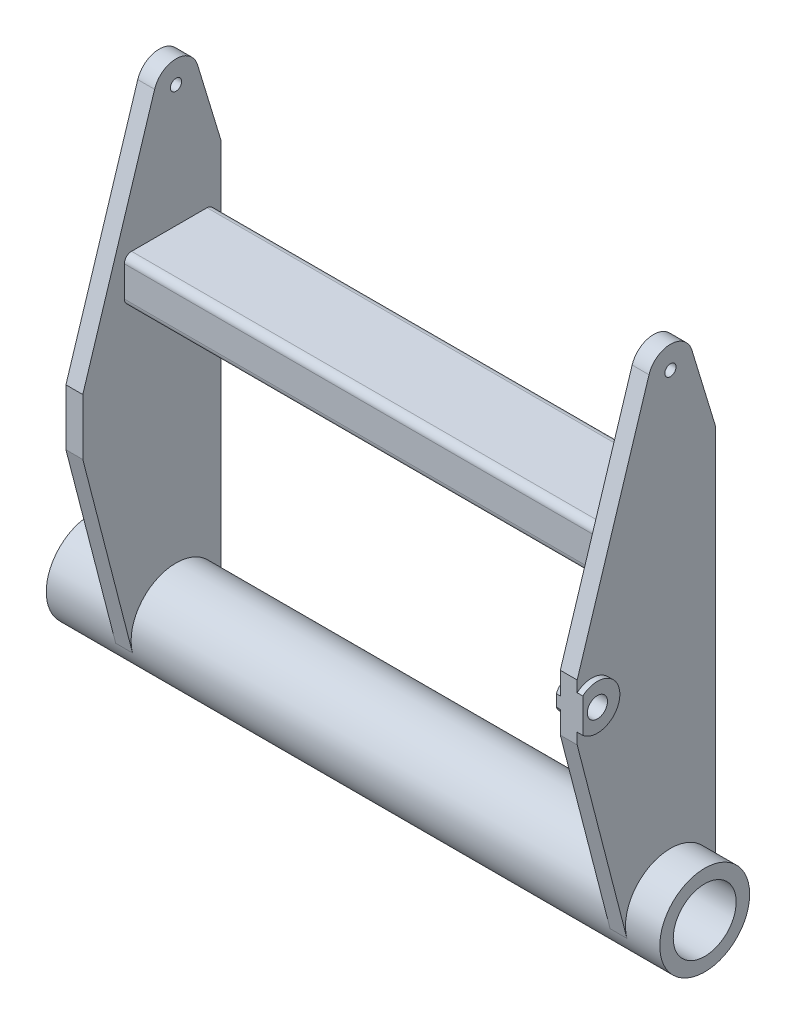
ISO-10303-21;
HEADER;
FILE_DESCRIPTION(('STEP AP214'),'2;1');
FILE_NAME('part.step','',(''),(''),'','','');
FILE_SCHEMA(('AUTOMOTIVE_DESIGN { 1 0 10303 214 1 1 1 1 }'));
ENDSEC;
DATA;
#1=APPLICATION_CONTEXT('core data for automotive mechanical design processes');
#2=APPLICATION_PROTOCOL_DEFINITION('international standard','automotive_design',2000,#1);
#3=PRODUCT_CONTEXT('',#1,'mechanical');
#4=PRODUCT('Part','Part','',(#3));
#5=PRODUCT_RELATED_PRODUCT_CATEGORY('part','',(#4));
#6=PRODUCT_DEFINITION_FORMATION('','',#4);
#7=PRODUCT_DEFINITION_CONTEXT('part definition',#1,'design');
#8=PRODUCT_DEFINITION('design','',#6,#7);
#9=PRODUCT_DEFINITION_SHAPE('','',#8);
#10=(LENGTH_UNIT() NAMED_UNIT(*) SI_UNIT(.MILLI.,.METRE.));
#11=(NAMED_UNIT(*) PLANE_ANGLE_UNIT() SI_UNIT($,.RADIAN.));
#12=(NAMED_UNIT(*) SI_UNIT($,.STERADIAN.) SOLID_ANGLE_UNIT());
#13=UNCERTAINTY_MEASURE_WITH_UNIT(LENGTH_MEASURE(1.E-05),#10,'distance_accuracy_value','');
#14=(GEOMETRIC_REPRESENTATION_CONTEXT(3) GLOBAL_UNCERTAINTY_ASSIGNED_CONTEXT((#13)) GLOBAL_UNIT_ASSIGNED_CONTEXT((#10,
#11,#12)) REPRESENTATION_CONTEXT('',''));
#15=CARTESIAN_POINT('',(0.,0.,0.));
#16=DIRECTION('',(0.,0.,1.));
#17=DIRECTION('',(1.,0.,0.));
#18=AXIS2_PLACEMENT_3D('',#15,#16,#17);
#19=CARTESIAN_POINT('',(212.5,0.,0.));
#20=DIRECTION('',(1.,0.,0.));
#21=DIRECTION('',(0.,0.,-1.));
#22=AXIS2_PLACEMENT_3D('',#19,#20,#21);
#23=PLANE('',#22);
#24=CARTESIAN_POINT('',(212.5,408.6,0.));
#25=DIRECTION('',(1.,0.,0.));
#26=DIRECTION('',(0.,0.,-1.));
#27=AXIS2_PLACEMENT_3D('',#24,#25,#26);
#28=CIRCLE('',#27,5.);
#29=CARTESIAN_POINT('',(212.5,408.6,-5.));
#30=VERTEX_POINT('',#29);
#31=EDGE_CURVE('E548',#30,#30,#28,.T.);
#32=ORIENTED_EDGE('',*,*,#31,.T.);
#33=EDGE_LOOP('',(#32));
#34=FACE_BOUND('',#33,.T.);
#35=CARTESIAN_POINT('',(212.5,293.6,-27.6));
#36=DIRECTION('',(-1.,0.,0.));
#37=DIRECTION('',(0.,0.,-1.));
#38=AXIS2_PLACEMENT_3D('',#35,#36,#37);
#39=CIRCLE('',#38,6.39999999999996);
#40=CARTESIAN_POINT('',(212.5,300.,-27.6));
#41=VERTEX_POINT('',#40);
#42=CARTESIAN_POINT('',(212.5,293.6,-34.));
#43=VERTEX_POINT('',#42);
#44=EDGE_CURVE('E396',#41,#43,#39,.T.);
#45=ORIENTED_EDGE('',*,*,#44,.F.);
#46=DIRECTION('',(0.,0.,-1.));
#47=VECTOR('',#46,1.);
#48=CARTESIAN_POINT('',(212.5,300.,-27.6));
#49=LINE('',#48,#47);
#50=CARTESIAN_POINT('',(212.5,300.,39.6));
#51=VERTEX_POINT('',#50);
#52=EDGE_CURVE('E375',#51,#41,#49,.T.);
#53=ORIENTED_EDGE('',*,*,#52,.F.);
#54=CARTESIAN_POINT('',(212.5,293.6,39.6));
#55=DIRECTION('',(-1.,0.,0.));
#56=DIRECTION('',(0.,0.,-1.));
#57=AXIS2_PLACEMENT_3D('',#54,#55,#56);
#58=CIRCLE('',#57,6.40000000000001);
#59=CARTESIAN_POINT('',(212.5,293.6,46.));
#60=VERTEX_POINT('',#59);
#61=EDGE_CURVE('E378',#60,#51,#58,.T.);
#62=ORIENTED_EDGE('',*,*,#61,.F.);
#63=DIRECTION('',(0.,1.,0.));
#64=VECTOR('',#63,1.);
#65=CARTESIAN_POINT('',(212.5,293.6,46.));
#66=LINE('',#65,#64);
#67=CARTESIAN_POINT('',(212.5,266.4,46.));
#68=VERTEX_POINT('',#67);
#69=EDGE_CURVE('E381',#68,#60,#66,.T.);
#70=ORIENTED_EDGE('',*,*,#69,.F.);
#71=CARTESIAN_POINT('',(212.5,266.4,39.6));
#72=DIRECTION('',(-1.,0.,0.));
#73=DIRECTION('',(0.,0.,-1.));
#74=AXIS2_PLACEMENT_3D('',#71,#72,#73);
#75=CIRCLE('',#74,6.39999999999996);
#76=CARTESIAN_POINT('',(212.5,260.,39.6));
#77=VERTEX_POINT('',#76);
#78=EDGE_CURVE('E384',#77,#68,#75,.T.);
#79=ORIENTED_EDGE('',*,*,#78,.F.);
#80=DIRECTION('',(0.,0.,1.));
#81=VECTOR('',#80,1.);
#82=CARTESIAN_POINT('',(212.5,260.,-27.6));
#83=LINE('',#82,#81);
#84=CARTESIAN_POINT('',(212.5,260.,-27.6));
#85=VERTEX_POINT('',#84);
#86=EDGE_CURVE('E387',#85,#77,#83,.T.);
#87=ORIENTED_EDGE('',*,*,#86,.F.);
#88=CARTESIAN_POINT('',(212.5,266.4,-27.6));
#89=DIRECTION('',(-1.,0.,0.));
#90=DIRECTION('',(0.,0.,-1.));
#91=AXIS2_PLACEMENT_3D('',#88,#89,#90);
#92=CIRCLE('',#91,6.39999999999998);
#93=CARTESIAN_POINT('',(212.5,266.4,-34.));
#94=VERTEX_POINT('',#93);
#95=EDGE_CURVE('E390',#94,#85,#92,.T.);
#96=ORIENTED_EDGE('',*,*,#95,.F.);
#97=DIRECTION('',(0.,-1.,0.));
#98=VECTOR('',#97,1.);
#99=CARTESIAN_POINT('',(212.5,293.6,-34.));
#100=LINE('',#99,#98);
#101=EDGE_CURVE('E393',#43,#94,#100,.T.);
#102=ORIENTED_EDGE('',*,*,#101,.F.);
#103=EDGE_LOOP('',(#45,#53,#62,#70,#79,#87,#96,#102));
#104=FACE_BOUND('',#103,.T.);
#105=CARTESIAN_POINT('',(212.5,186.3,70.));
#106=DIRECTION('',(-1.,0.,0.));
#107=DIRECTION('',(0.,0.,1.));
#108=AXIS2_PLACEMENT_3D('',#105,#106,#107);
#109=CIRCLE('',#108,14.);
#110=CARTESIAN_POINT('',(212.5,191.496152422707,83.));
#111=VERTEX_POINT('',#110);
#112=CARTESIAN_POINT('',(212.5,181.103847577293,83.));
#113=VERTEX_POINT('',#112);
#114=EDGE_CURVE('E44',#111,#113,#109,.T.);
#115=ORIENTED_EDGE('',*,*,#114,.F.);
#116=DIRECTION('',(0.,-1.,0.));
#117=VECTOR('',#116,1.);
#118=CARTESIAN_POINT('',(212.5,161.3,83.));
#119=LINE('',#118,#117);
#120=CARTESIAN_POINT('',(212.5,211.3,83.));
#121=VERTEX_POINT('',#120);
#122=EDGE_CURVE('E264',#121,#111,#119,.T.);
#123=ORIENTED_EDGE('',*,*,#122,.F.);
#124=DIRECTION('',(0.,-0.953957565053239,0.299941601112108));
#125=VECTOR('',#124,1.);
#126=CARTESIAN_POINT('',(212.5,211.3,83.));
#127=LINE('',#126,#125);
#128=CARTESIAN_POINT('',(212.5,414.598832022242,19.0791513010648));
#129=VERTEX_POINT('',#128);
#130=EDGE_CURVE('E278',#129,#121,#127,.T.);
#131=ORIENTED_EDGE('',*,*,#130,.F.);
#132=CARTESIAN_POINT('',(212.5,408.6,0.));
#133=DIRECTION('',(1.,0.,0.));
#134=DIRECTION('',(0.,0.,-1.));
#135=AXIS2_PLACEMENT_3D('',#132,#133,#134);
#136=CIRCLE('',#135,20.);
#137=CARTESIAN_POINT('',(212.5,414.414043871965,-19.1362716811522));
#138=VERTEX_POINT('',#137);
#139=EDGE_CURVE('E320',#138,#129,#136,.T.);
#140=ORIENTED_EDGE('',*,*,#139,.F.);
#141=DIRECTION('',(0.,0.956813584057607,0.290702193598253));
#142=VECTOR('',#141,1.);
#143=CARTESIAN_POINT('',(212.5,345.743428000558,-40.));
#144=LINE('',#143,#142);
#145=CARTESIAN_POINT('',(212.5,345.743428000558,-40.));
#146=VERTEX_POINT('',#145);
#147=EDGE_CURVE('E316',#146,#138,#144,.T.);
#148=ORIENTED_EDGE('',*,*,#147,.F.);
#149=DIRECTION('',(0.,1.,0.));
#150=VECTOR('',#149,1.);
#151=CARTESIAN_POINT('',(212.5,0.,-40.));
#152=LINE('',#151,#150);
#153=CARTESIAN_POINT('',(212.5,0.,-40.));
#154=VERTEX_POINT('',#153);
#155=EDGE_CURVE('E319',#154,#146,#152,.T.);
#156=ORIENTED_EDGE('',*,*,#155,.F.);
#157=CARTESIAN_POINT('',(212.5,0.,0.));
#158=DIRECTION('',(-1.,0.,0.));
#159=DIRECTION('',(0.,0.,-1.));
#160=AXIS2_PLACEMENT_3D('',#157,#158,#159);
#161=CIRCLE('',#160,40.);
#162=CARTESIAN_POINT('',(212.5,-10.0086252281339,38.727605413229));
#163=VERTEX_POINT('',#162);
#164=EDGE_CURVE('E322',#163,#154,#161,.T.);
#165=ORIENTED_EDGE('',*,*,#164,.F.);
#166=DIRECTION('',(0.,-0.968190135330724,-0.250215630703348));
#167=VECTOR('',#166,1.);
#168=CARTESIAN_POINT('',(212.5,-10.0086252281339,38.727605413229));
#169=LINE('',#168,#167);
#170=CARTESIAN_POINT('',(212.5,161.3,83.));
#171=VERTEX_POINT('',#170);
#172=EDGE_CURVE('E273',#171,#163,#169,.T.);
#173=ORIENTED_EDGE('',*,*,#172,.F.);
#174=EDGE_CURVE('E266',#113,#171,#119,.T.);
#175=ORIENTED_EDGE('',*,*,#174,.F.);
#176=EDGE_LOOP('',(#115,#123,#131,#140,#148,#156,#165,#173,#175));
#177=FACE_BOUND('',#176,.T.);
#178=ADVANCED_FACE('F27',(#34,#104,#177),#23,.F.);
#179=CARTESIAN_POINT('',(227.5,0.,0.));
#180=DIRECTION('',(1.,0.,0.));
#181=DIRECTION('',(0.,0.,-1.));
#182=AXIS2_PLACEMENT_3D('',#179,#180,#181);
#183=PLANE('',#182);
#184=CARTESIAN_POINT('',(227.5,408.6,0.));
#185=DIRECTION('',(1.,0.,0.));
#186=DIRECTION('',(0.,0.,-1.));
#187=AXIS2_PLACEMENT_3D('',#184,#185,#186);
#188=CIRCLE('',#187,5.);
#189=CARTESIAN_POINT('',(227.5,408.6,-5.));
#190=VERTEX_POINT('',#189);
#191=EDGE_CURVE('E554',#190,#190,#188,.T.);
#192=ORIENTED_EDGE('',*,*,#191,.F.);
#193=EDGE_LOOP('',(#192));
#194=FACE_BOUND('',#193,.T.);
#195=DIRECTION('',(0.,-1.,0.));
#196=VECTOR('',#195,1.);
#197=CARTESIAN_POINT('',(227.5,161.3,83.));
#198=LINE('',#197,#196);
#199=CARTESIAN_POINT('',(227.5,211.3,83.));
#200=VERTEX_POINT('',#199);
#201=CARTESIAN_POINT('',(227.5,201.498684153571,83.));
#202=VERTEX_POINT('',#201);
#203=EDGE_CURVE('E52',#200,#202,#198,.T.);
#204=ORIENTED_EDGE('',*,*,#203,.T.);
#205=CARTESIAN_POINT('',(227.5,186.3,70.));
#206=DIRECTION('',(1.,0.,0.));
#207=DIRECTION('',(0.,0.,-1.));
#208=AXIS2_PLACEMENT_3D('',#205,#206,#207);
#209=CIRCLE('',#208,20.);
#210=CARTESIAN_POINT('',(227.5,171.101315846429,83.));
#211=VERTEX_POINT('',#210);
#212=EDGE_CURVE('E537',#211,#202,#209,.T.);
#213=ORIENTED_EDGE('',*,*,#212,.F.);
#214=CARTESIAN_POINT('',(227.5,161.3,83.));
#215=VERTEX_POINT('',#214);
#216=EDGE_CURVE('E292',#211,#215,#198,.T.);
#217=ORIENTED_EDGE('',*,*,#216,.T.);
#218=DIRECTION('',(0.,-0.968190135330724,-0.250215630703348));
#219=VECTOR('',#218,1.);
#220=CARTESIAN_POINT('',(227.5,-10.0086252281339,38.727605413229));
#221=LINE('',#220,#219);
#222=CARTESIAN_POINT('',(227.5,-10.0086252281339,38.727605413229));
#223=VERTEX_POINT('',#222);
#224=EDGE_CURVE('E294',#215,#223,#221,.T.);
#225=ORIENTED_EDGE('',*,*,#224,.T.);
#226=CARTESIAN_POINT('',(227.5,0.,0.));
#227=DIRECTION('',(-1.,0.,0.));
#228=DIRECTION('',(0.,0.,-1.));
#229=AXIS2_PLACEMENT_3D('',#226,#227,#228);
#230=CIRCLE('',#229,40.);
#231=CARTESIAN_POINT('',(227.5,0.,-40.));
#232=VERTEX_POINT('',#231);
#233=EDGE_CURVE('E276',#223,#232,#230,.T.);
#234=ORIENTED_EDGE('',*,*,#233,.T.);
#235=DIRECTION('',(0.,1.,0.));
#236=VECTOR('',#235,1.);
#237=CARTESIAN_POINT('',(227.5,0.,-40.));
#238=LINE('',#237,#236);
#239=CARTESIAN_POINT('',(227.5,345.743428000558,-40.));
#240=VERTEX_POINT('',#239);
#241=EDGE_CURVE('E284',#232,#240,#238,.T.);
#242=ORIENTED_EDGE('',*,*,#241,.T.);
#243=DIRECTION('',(0.,0.956813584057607,0.290702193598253));
#244=VECTOR('',#243,1.);
#245=CARTESIAN_POINT('',(227.5,345.743428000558,-40.));
#246=LINE('',#245,#244);
#247=CARTESIAN_POINT('',(227.5,414.414043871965,-19.1362716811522));
#248=VERTEX_POINT('',#247);
#249=EDGE_CURVE('E286',#240,#248,#246,.T.);
#250=ORIENTED_EDGE('',*,*,#249,.T.);
#251=CARTESIAN_POINT('',(227.5,408.6,0.));
#252=DIRECTION('',(1.,0.,0.));
#253=DIRECTION('',(0.,0.,-1.));
#254=AXIS2_PLACEMENT_3D('',#251,#252,#253);
#255=CIRCLE('',#254,20.);
#256=CARTESIAN_POINT('',(227.5,414.598832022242,19.0791513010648));
#257=VERTEX_POINT('',#256);
#258=EDGE_CURVE('E288',#248,#257,#255,.T.);
#259=ORIENTED_EDGE('',*,*,#258,.T.);
#260=DIRECTION('',(0.,-0.953957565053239,0.299941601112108));
#261=VECTOR('',#260,1.);
#262=CARTESIAN_POINT('',(227.5,211.3,83.));
#263=LINE('',#262,#261);
#264=EDGE_CURVE('E290',#257,#200,#263,.T.);
#265=ORIENTED_EDGE('',*,*,#264,.T.);
#266=EDGE_LOOP('',(#204,#213,#217,#225,#234,#242,#250,#259,#265));
#267=FACE_BOUND('',#266,.T.);
#268=ADVANCED_FACE('F578',(#194,#267),#183,.T.);
#269=CARTESIAN_POINT('',(227.5,0.,-40.));
#270=DIRECTION('',(0.,0.,1.));
#271=DIRECTION('',(0.,-1.,0.));
#272=AXIS2_PLACEMENT_3D('',#269,#270,#271);
#273=PLANE('',#272);
#274=ORIENTED_EDGE('',*,*,#155,.T.);
#275=DIRECTION('',(-1.,0.,0.));
#276=VECTOR('',#275,1.);
#277=CARTESIAN_POINT('',(227.5,345.743428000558,-40.));
#278=LINE('',#277,#276);
#279=EDGE_CURVE('E37',#240,#146,#278,.T.);
#280=ORIENTED_EDGE('',*,*,#279,.F.);
#281=ORIENTED_EDGE('',*,*,#241,.F.);
#282=DIRECTION('',(-1.,0.,0.));
#283=VECTOR('',#282,1.);
#284=CARTESIAN_POINT('',(227.5,0.,-40.));
#285=LINE('',#284,#283);
#286=EDGE_CURVE('E11',#232,#154,#285,.T.);
#287=ORIENTED_EDGE('',*,*,#286,.T.);
#288=EDGE_LOOP('',(#274,#280,#281,#287));
#289=FACE_BOUND('',#288,.T.);
#290=ADVANCED_FACE('F29',(#289),#273,.F.);
#291=CARTESIAN_POINT('',(227.5,345.743428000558,-40.));
#292=DIRECTION('',(0.,-0.290702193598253,0.956813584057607));
#293=DIRECTION('',(0.,-0.956813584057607,-0.290702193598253));
#294=AXIS2_PLACEMENT_3D('',#291,#292,#293);
#295=PLANE('',#294);
#296=ORIENTED_EDGE('',*,*,#147,.T.);
#297=DIRECTION('',(-1.,0.,0.));
#298=VECTOR('',#297,1.);
#299=CARTESIAN_POINT('',(227.5,414.414043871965,-19.1362716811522));
#300=LINE('',#299,#298);
#301=EDGE_CURVE('E306',#248,#138,#300,.T.);
#302=ORIENTED_EDGE('',*,*,#301,.F.);
#303=ORIENTED_EDGE('',*,*,#249,.F.);
#304=ORIENTED_EDGE('',*,*,#279,.T.);
#305=EDGE_LOOP('',(#296,#302,#303,#304));
#306=FACE_BOUND('',#305,.T.);
#307=ADVANCED_FACE('F314',(#306),#295,.F.);
#308=CARTESIAN_POINT('',(227.5,408.6,0.));
#309=DIRECTION('',(-1.,0.,0.));
#310=DIRECTION('',(0.,0.,1.));
#311=AXIS2_PLACEMENT_3D('',#308,#309,#310);
#312=CYLINDRICAL_SURFACE('',#311,20.);
#313=ORIENTED_EDGE('',*,*,#139,.T.);
#314=DIRECTION('',(-1.,0.,0.));
#315=VECTOR('',#314,1.);
#316=CARTESIAN_POINT('',(227.5,414.598832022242,19.0791513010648));
#317=LINE('',#316,#315);
#318=EDGE_CURVE('E303',#257,#129,#317,.T.);
#319=ORIENTED_EDGE('',*,*,#318,.F.);
#320=ORIENTED_EDGE('',*,*,#258,.F.);
#321=ORIENTED_EDGE('',*,*,#301,.T.);
#322=EDGE_LOOP('',(#313,#319,#320,#321));
#323=FACE_BOUND('',#322,.T.);
#324=ADVANCED_FACE('F753',(#323),#312,.T.);
#325=CARTESIAN_POINT('',(227.5,211.3,83.));
#326=DIRECTION('',(0.,-0.299941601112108,-0.953957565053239));
#327=DIRECTION('',(0.,0.953957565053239,-0.299941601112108));
#328=AXIS2_PLACEMENT_3D('',#325,#326,#327);
#329=PLANE('',#328);
#330=ORIENTED_EDGE('',*,*,#130,.T.);
#331=DIRECTION('',(-1.,0.,0.));
#332=VECTOR('',#331,1.);
#333=CARTESIAN_POINT('',(227.5,211.3,83.));
#334=LINE('',#333,#332);
#335=EDGE_CURVE('E272',#200,#121,#334,.T.);
#336=ORIENTED_EDGE('',*,*,#335,.F.);
#337=ORIENTED_EDGE('',*,*,#264,.F.);
#338=ORIENTED_EDGE('',*,*,#318,.T.);
#339=EDGE_LOOP('',(#330,#336,#337,#338));
#340=FACE_BOUND('',#339,.T.);
#341=ADVANCED_FACE('F757',(#340),#329,.F.);
#342=CARTESIAN_POINT('',(227.5,161.3,83.));
#343=DIRECTION('',(0.,0.,-1.));
#344=DIRECTION('',(-1.,0.,0.));
#345=AXIS2_PLACEMENT_3D('',#342,#343,#344);
#346=PLANE('',#345);
#347=ORIENTED_EDGE('',*,*,#122,.T.);
#348=DIRECTION('',(1.,0.,0.));
#349=VECTOR('',#348,1.);
#350=CARTESIAN_POINT('',(209.,191.496152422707,83.));
#351=LINE('',#350,#349);
#352=CARTESIAN_POINT('',(209.,191.496152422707,83.));
#353=VERTEX_POINT('',#352);
#354=EDGE_CURVE('E251',#353,#111,#351,.T.);
#355=ORIENTED_EDGE('',*,*,#354,.F.);
#356=DIRECTION('',(0.,1.,0.));
#357=VECTOR('',#356,1.);
#358=CARTESIAN_POINT('',(209.,191.496152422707,83.));
#359=LINE('',#358,#357);
#360=CARTESIAN_POINT('',(209.,181.103847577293,83.));
#361=VERTEX_POINT('',#360);
#362=EDGE_CURVE('E258',#361,#353,#359,.T.);
#363=ORIENTED_EDGE('',*,*,#362,.F.);
#364=DIRECTION('',(1.,0.,0.));
#365=VECTOR('',#364,1.);
#366=CARTESIAN_POINT('',(209.,181.103847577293,83.));
#367=LINE('',#366,#365);
#368=EDGE_CURVE('E257',#361,#113,#367,.T.);
#369=ORIENTED_EDGE('',*,*,#368,.T.);
#370=ORIENTED_EDGE('',*,*,#174,.T.);
#371=DIRECTION('',(-1.,0.,0.));
#372=VECTOR('',#371,1.);
#373=CARTESIAN_POINT('',(227.5,161.3,83.));
#374=LINE('',#373,#372);
#375=EDGE_CURVE('E299',#215,#171,#374,.T.);
#376=ORIENTED_EDGE('',*,*,#375,.F.);
#377=ORIENTED_EDGE('',*,*,#216,.F.);
#378=DIRECTION('',(-1.,0.,0.));
#379=VECTOR('',#378,1.);
#380=CARTESIAN_POINT('',(232.5,171.101315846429,83.));
#381=LINE('',#380,#379);
#382=CARTESIAN_POINT('',(232.5,171.101315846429,83.));
#383=VERTEX_POINT('',#382);
#384=EDGE_CURVE('E529',#383,#211,#381,.T.);
#385=ORIENTED_EDGE('',*,*,#384,.F.);
#386=DIRECTION('',(0.,-1.,0.));
#387=VECTOR('',#386,1.);
#388=CARTESIAN_POINT('',(232.5,201.498684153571,83.));
#389=LINE('',#388,#387);
#390=CARTESIAN_POINT('',(232.5,201.498684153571,83.));
#391=VERTEX_POINT('',#390);
#392=EDGE_CURVE('E532',#391,#383,#389,.T.);
#393=ORIENTED_EDGE('',*,*,#392,.F.);
#394=DIRECTION('',(-1.,0.,0.));
#395=VECTOR('',#394,1.);
#396=CARTESIAN_POINT('',(232.5,201.498684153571,83.));
#397=LINE('',#396,#395);
#398=EDGE_CURVE('E527',#391,#202,#397,.T.);
#399=ORIENTED_EDGE('',*,*,#398,.T.);
#400=ORIENTED_EDGE('',*,*,#203,.F.);
#401=ORIENTED_EDGE('',*,*,#335,.T.);
#402=EDGE_LOOP('',(#347,#355,#363,#369,#370,#376,#377,#385,#393,#399,#400,#401));
#403=FACE_BOUND('',#402,.T.);
#404=ADVANCED_FACE('F270',(#403),#346,.F.);
#405=CARTESIAN_POINT('',(227.5,-10.0086252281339,38.727605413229));
#406=DIRECTION('',(0.,0.250215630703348,-0.968190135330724));
#407=DIRECTION('',(0.,0.968190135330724,0.250215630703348));
#408=AXIS2_PLACEMENT_3D('',#405,#406,#407);
#409=PLANE('',#408);
#410=ORIENTED_EDGE('',*,*,#172,.T.);
#411=DIRECTION('',(-1.,0.,0.));
#412=VECTOR('',#411,1.);
#413=CARTESIAN_POINT('',(227.5,-10.0086252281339,38.727605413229));
#414=LINE('',#413,#412);
#415=EDGE_CURVE('E296',#223,#163,#414,.T.);
#416=ORIENTED_EDGE('',*,*,#415,.F.);
#417=ORIENTED_EDGE('',*,*,#224,.F.);
#418=ORIENTED_EDGE('',*,*,#375,.T.);
#419=EDGE_LOOP('',(#410,#416,#417,#418));
#420=FACE_BOUND('',#419,.T.);
#421=ADVANCED_FACE('F722',(#420),#409,.F.);
#422=CARTESIAN_POINT('',(227.5,186.3,70.));
#423=DIRECTION('',(-1.,0.,0.));
#424=DIRECTION('',(0.,0.,1.));
#425=AXIS2_PLACEMENT_3D('',#422,#423,#424);
#426=CYLINDRICAL_SURFACE('',#425,9.00000000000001);
#427=CARTESIAN_POINT('',(232.5,186.3,70.));
#428=DIRECTION('',(1.,0.,0.));
#429=DIRECTION('',(0.,0.,-1.));
#430=AXIS2_PLACEMENT_3D('',#427,#428,#429);
#431=CIRCLE('',#430,9.00000000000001);
#432=CARTESIAN_POINT('',(232.5,186.3,61.));
#433=VERTEX_POINT('',#432);
#434=EDGE_CURVE('E540',#433,#433,#431,.T.);
#435=ORIENTED_EDGE('',*,*,#434,.T.);
#436=EDGE_LOOP('',(#435));
#437=FACE_BOUND('',#436,.T.);
#438=CARTESIAN_POINT('',(209.,186.3,70.));
#439=DIRECTION('',(-1.,0.,0.));
#440=DIRECTION('',(0.,0.,1.));
#441=AXIS2_PLACEMENT_3D('',#438,#439,#440);
#442=CIRCLE('',#441,9.00000000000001);
#443=CARTESIAN_POINT('',(209.,186.3,79.));
#444=VERTEX_POINT('',#443);
#445=EDGE_CURVE('E267',#444,#444,#442,.T.);
#446=ORIENTED_EDGE('',*,*,#445,.T.);
#447=EDGE_LOOP('',(#446));
#448=FACE_BOUND('',#447,.T.);
#449=ADVANCED_FACE('F719',(#437,#448),#426,.F.);
#450=CARTESIAN_POINT('',(-212.5,293.6,-27.6));
#451=DIRECTION('',(1.,0.,0.));
#452=DIRECTION('',(0.,0.,-1.));
#453=AXIS2_PLACEMENT_3D('',#450,#451,#452);
#454=CYLINDRICAL_SURFACE('',#453,6.39999999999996);
#455=ORIENTED_EDGE('',*,*,#44,.T.);
#456=DIRECTION('',(1.,0.,0.));
#457=VECTOR('',#456,1.);
#458=CARTESIAN_POINT('',(-212.5,293.6,-34.));
#459=LINE('',#458,#457);
#460=CARTESIAN_POINT('',(-212.5,293.6,-34.));
#461=VERTEX_POINT('',#460);
#462=EDGE_CURVE('E327',#461,#43,#459,.T.);
#463=ORIENTED_EDGE('',*,*,#462,.F.);
#464=CARTESIAN_POINT('',(-212.5,293.6,-27.6));
#465=DIRECTION('',(-1.,0.,0.));
#466=DIRECTION('',(0.,0.,-1.));
#467=AXIS2_PLACEMENT_3D('',#464,#465,#466);
#468=CIRCLE('',#467,6.39999999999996);
#469=CARTESIAN_POINT('',(-212.5,300.,-27.6));
#470=VERTEX_POINT('',#469);
#471=EDGE_CURVE('E372',#470,#461,#468,.T.);
#472=ORIENTED_EDGE('',*,*,#471,.F.);
#473=DIRECTION('',(1.,0.,0.));
#474=VECTOR('',#473,1.);
#475=CARTESIAN_POINT('',(-212.5,300.,-27.6));
#476=LINE('',#475,#474);
#477=EDGE_CURVE('E348',#470,#41,#476,.T.);
#478=ORIENTED_EDGE('',*,*,#477,.T.);
#479=EDGE_LOOP('',(#455,#463,#472,#478));
#480=FACE_BOUND('',#479,.T.);
#481=ADVANCED_FACE('F716',(#480),#454,.T.);
#482=CARTESIAN_POINT('',(-212.5,293.6,-34.));
#483=DIRECTION('',(0.,0.,1.));
#484=DIRECTION('',(0.,-1.,0.));
#485=AXIS2_PLACEMENT_3D('',#482,#483,#484);
#486=PLANE('',#485);
#487=ORIENTED_EDGE('',*,*,#101,.T.);
#488=DIRECTION('',(1.,0.,0.));
#489=VECTOR('',#488,1.);
#490=CARTESIAN_POINT('',(-212.5,266.4,-34.));
#491=LINE('',#490,#489);
#492=CARTESIAN_POINT('',(-212.5,266.4,-34.));
#493=VERTEX_POINT('',#492);
#494=EDGE_CURVE('E330',#493,#94,#491,.T.);
#495=ORIENTED_EDGE('',*,*,#494,.F.);
#496=DIRECTION('',(0.,-1.,0.));
#497=VECTOR('',#496,1.);
#498=CARTESIAN_POINT('',(-212.5,293.6,-34.));
#499=LINE('',#498,#497);
#500=EDGE_CURVE('E369',#461,#493,#499,.T.);
#501=ORIENTED_EDGE('',*,*,#500,.F.);
#502=ORIENTED_EDGE('',*,*,#462,.T.);
#503=EDGE_LOOP('',(#487,#495,#501,#502));
#504=FACE_BOUND('',#503,.T.);
#505=ADVANCED_FACE('F712',(#504),#486,.F.);
#506=CARTESIAN_POINT('',(-212.5,266.4,-27.6));
#507=DIRECTION('',(1.,0.,0.));
#508=DIRECTION('',(0.,0.,-1.));
#509=AXIS2_PLACEMENT_3D('',#506,#507,#508);
#510=CYLINDRICAL_SURFACE('',#509,6.39999999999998);
#511=ORIENTED_EDGE('',*,*,#95,.T.);
#512=DIRECTION('',(1.,0.,0.));
#513=VECTOR('',#512,1.);
#514=CARTESIAN_POINT('',(-212.5,260.,-27.6));
#515=LINE('',#514,#513);
#516=CARTESIAN_POINT('',(-212.5,260.,-27.6));
#517=VERTEX_POINT('',#516);
#518=EDGE_CURVE('E333',#517,#85,#515,.T.);
#519=ORIENTED_EDGE('',*,*,#518,.F.);
#520=CARTESIAN_POINT('',(-212.5,266.4,-27.6));
#521=DIRECTION('',(-1.,0.,0.));
#522=DIRECTION('',(0.,0.,-1.));
#523=AXIS2_PLACEMENT_3D('',#520,#521,#522);
#524=CIRCLE('',#523,6.39999999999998);
#525=EDGE_CURVE('E366',#493,#517,#524,.T.);
#526=ORIENTED_EDGE('',*,*,#525,.F.);
#527=ORIENTED_EDGE('',*,*,#494,.T.);
#528=EDGE_LOOP('',(#511,#519,#526,#527));
#529=FACE_BOUND('',#528,.T.);
#530=ADVANCED_FACE('F708',(#529),#510,.T.);
#531=CARTESIAN_POINT('',(-212.5,260.,-27.6));
#532=DIRECTION('',(0.,1.,0.));
#533=DIRECTION('',(0.,0.,1.));
#534=AXIS2_PLACEMENT_3D('',#531,#532,#533);
#535=PLANE('',#534);
#536=ORIENTED_EDGE('',*,*,#86,.T.);
#537=DIRECTION('',(1.,0.,0.));
#538=VECTOR('',#537,1.);
#539=CARTESIAN_POINT('',(-212.5,260.,39.6));
#540=LINE('',#539,#538);
#541=CARTESIAN_POINT('',(-212.5,260.,39.6));
#542=VERTEX_POINT('',#541);
#543=EDGE_CURVE('E336',#542,#77,#540,.T.);
#544=ORIENTED_EDGE('',*,*,#543,.F.);
#545=DIRECTION('',(0.,0.,1.));
#546=VECTOR('',#545,1.);
#547=CARTESIAN_POINT('',(-212.5,260.,-27.6));
#548=LINE('',#547,#546);
#549=EDGE_CURVE('E363',#517,#542,#548,.T.);
#550=ORIENTED_EDGE('',*,*,#549,.F.);
#551=ORIENTED_EDGE('',*,*,#518,.T.);
#552=EDGE_LOOP('',(#536,#544,#550,#551));
#553=FACE_BOUND('',#552,.T.);
#554=ADVANCED_FACE('F704',(#553),#535,.F.);
#555=CARTESIAN_POINT('',(-212.5,266.4,39.6));
#556=DIRECTION('',(1.,0.,0.));
#557=DIRECTION('',(0.,0.,-1.));
#558=AXIS2_PLACEMENT_3D('',#555,#556,#557);
#559=CYLINDRICAL_SURFACE('',#558,6.39999999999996);
#560=ORIENTED_EDGE('',*,*,#78,.T.);
#561=DIRECTION('',(1.,0.,0.));
#562=VECTOR('',#561,1.);
#563=CARTESIAN_POINT('',(-212.5,266.4,46.));
#564=LINE('',#563,#562);
#565=CARTESIAN_POINT('',(-212.5,266.4,46.));
#566=VERTEX_POINT('',#565);
#567=EDGE_CURVE('E339',#566,#68,#564,.T.);
#568=ORIENTED_EDGE('',*,*,#567,.F.);
#569=CARTESIAN_POINT('',(-212.5,266.4,39.6));
#570=DIRECTION('',(-1.,0.,0.));
#571=DIRECTION('',(0.,0.,-1.));
#572=AXIS2_PLACEMENT_3D('',#569,#570,#571);
#573=CIRCLE('',#572,6.39999999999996);
#574=EDGE_CURVE('E360',#542,#566,#573,.T.);
#575=ORIENTED_EDGE('',*,*,#574,.F.);
#576=ORIENTED_EDGE('',*,*,#543,.T.);
#577=EDGE_LOOP('',(#560,#568,#575,#576));
#578=FACE_BOUND('',#577,.T.);
#579=ADVANCED_FACE('F700',(#578),#559,.T.);
#580=CARTESIAN_POINT('',(-212.5,293.6,46.));
#581=DIRECTION('',(0.,0.,-1.));
#582=DIRECTION('',(0.,1.,0.));
#583=AXIS2_PLACEMENT_3D('',#580,#581,#582);
#584=PLANE('',#583);
#585=ORIENTED_EDGE('',*,*,#69,.T.);
#586=DIRECTION('',(1.,0.,0.));
#587=VECTOR('',#586,1.);
#588=CARTESIAN_POINT('',(-212.5,293.6,46.));
#589=LINE('',#588,#587);
#590=CARTESIAN_POINT('',(-212.5,293.6,46.));
#591=VERTEX_POINT('',#590);
#592=EDGE_CURVE('E342',#591,#60,#589,.T.);
#593=ORIENTED_EDGE('',*,*,#592,.F.);
#594=DIRECTION('',(0.,1.,0.));
#595=VECTOR('',#594,1.);
#596=CARTESIAN_POINT('',(-212.5,293.6,46.));
#597=LINE('',#596,#595);
#598=EDGE_CURVE('E357',#566,#591,#597,.T.);
#599=ORIENTED_EDGE('',*,*,#598,.F.);
#600=ORIENTED_EDGE('',*,*,#567,.T.);
#601=EDGE_LOOP('',(#585,#593,#599,#600));
#602=FACE_BOUND('',#601,.T.);
#603=ADVANCED_FACE('F696',(#602),#584,.F.);
#604=CARTESIAN_POINT('',(-212.5,293.6,39.6));
#605=DIRECTION('',(1.,0.,0.));
#606=DIRECTION('',(0.,0.,-1.));
#607=AXIS2_PLACEMENT_3D('',#604,#605,#606);
#608=CYLINDRICAL_SURFACE('',#607,6.40000000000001);
#609=ORIENTED_EDGE('',*,*,#61,.T.);
#610=DIRECTION('',(1.,0.,0.));
#611=VECTOR('',#610,1.);
#612=CARTESIAN_POINT('',(-212.5,300.,39.6));
#613=LINE('',#612,#611);
#614=CARTESIAN_POINT('',(-212.5,300.,39.6));
#615=VERTEX_POINT('',#614);
#616=EDGE_CURVE('E345',#615,#51,#613,.T.);
#617=ORIENTED_EDGE('',*,*,#616,.F.);
#618=CARTESIAN_POINT('',(-212.5,293.6,39.6));
#619=DIRECTION('',(-1.,0.,0.));
#620=DIRECTION('',(0.,0.,-1.));
#621=AXIS2_PLACEMENT_3D('',#618,#619,#620);
#622=CIRCLE('',#621,6.40000000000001);
#623=EDGE_CURVE('E354',#591,#615,#622,.T.);
#624=ORIENTED_EDGE('',*,*,#623,.F.);
#625=ORIENTED_EDGE('',*,*,#592,.T.);
#626=EDGE_LOOP('',(#609,#617,#624,#625));
#627=FACE_BOUND('',#626,.T.);
#628=ADVANCED_FACE('F692',(#627),#608,.T.);
#629=CARTESIAN_POINT('',(-212.5,300.,-27.6));
#630=DIRECTION('',(0.,-1.,0.));
#631=DIRECTION('',(0.,0.,-1.));
#632=AXIS2_PLACEMENT_3D('',#629,#630,#631);
#633=PLANE('',#632);
#634=ORIENTED_EDGE('',*,*,#52,.T.);
#635=ORIENTED_EDGE('',*,*,#477,.F.);
#636=DIRECTION('',(0.,0.,-1.));
#637=VECTOR('',#636,1.);
#638=CARTESIAN_POINT('',(-212.5,300.,-27.6));
#639=LINE('',#638,#637);
#640=EDGE_CURVE('E351',#615,#470,#639,.T.);
#641=ORIENTED_EDGE('',*,*,#640,.F.);
#642=ORIENTED_EDGE('',*,*,#616,.T.);
#643=EDGE_LOOP('',(#634,#635,#641,#642));
#644=FACE_BOUND('',#643,.T.);
#645=ADVANCED_FACE('F675',(#644),#633,.F.);
#646=CARTESIAN_POINT('',(258.,0.,0.));
#647=DIRECTION('',(-1.,0.,0.));
#648=DIRECTION('',(0.,0.,1.));
#649=AXIS2_PLACEMENT_3D('',#646,#647,#648);
#650=CYLINDRICAL_SURFACE('',#649,40.);
#651=DIRECTION('',(1.,0.,0.));
#652=VECTOR('',#651,1.);
#653=CARTESIAN_POINT('',(-227.5,-10.008625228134,38.727605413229));
#654=LINE('',#653,#652);
#655=CARTESIAN_POINT('',(-227.5,-10.0086252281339,38.727605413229));
#656=VERTEX_POINT('',#655);
#657=CARTESIAN_POINT('',(-212.5,-10.008625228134,38.727605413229));
#658=VERTEX_POINT('',#657);
#659=EDGE_CURVE('E476',#656,#658,#654,.T.);
#660=ORIENTED_EDGE('',*,*,#659,.F.);
#661=CARTESIAN_POINT('',(-227.5,0.,0.));
#662=DIRECTION('',(1.,0.,0.));
#663=DIRECTION('',(0.,0.,1.));
#664=AXIS2_PLACEMENT_3D('',#661,#662,#663);
#665=CIRCLE('',#664,40.);
#666=CARTESIAN_POINT('',(-227.5,0.,-40.));
#667=VERTEX_POINT('',#666);
#668=EDGE_CURVE('E509',#667,#656,#665,.T.);
#669=ORIENTED_EDGE('',*,*,#668,.F.);
#670=DIRECTION('',(1.,0.,0.));
#671=VECTOR('',#670,1.);
#672=CARTESIAN_POINT('',(-227.5,0.,-40.));
#673=LINE('',#672,#671);
#674=CARTESIAN_POINT('',(-212.5,0.,-40.));
#675=VERTEX_POINT('',#674);
#676=EDGE_CURVE('E494',#667,#675,#673,.T.);
#677=ORIENTED_EDGE('',*,*,#676,.T.);
#678=CARTESIAN_POINT('',(-212.5,0.,0.));
#679=DIRECTION('',(1.,0.,0.));
#680=DIRECTION('',(0.,0.,1.));
#681=AXIS2_PLACEMENT_3D('',#678,#679,#680);
#682=CIRCLE('',#681,40.);
#683=EDGE_CURVE('E525',#675,#658,#682,.T.);
#684=ORIENTED_EDGE('',*,*,#683,.T.);
#685=EDGE_LOOP('',(#660,#669,#677,#684));
#686=FACE_BOUND('',#685,.T.);
#687=CARTESIAN_POINT('',(-288.,0.,0.));
#688=DIRECTION('',(1.,0.,0.));
#689=DIRECTION('',(0.,0.,-1.));
#690=AXIS2_PLACEMENT_3D('',#687,#688,#689);
#691=CIRCLE('',#690,40.);
#692=CARTESIAN_POINT('',(-288.,0.,-40.));
#693=VERTEX_POINT('',#692);
#694=EDGE_CURVE('E470',#693,#693,#691,.T.);
#695=ORIENTED_EDGE('',*,*,#694,.T.);
#696=EDGE_LOOP('',(#695));
#697=FACE_BOUND('',#696,.T.);
#698=CARTESIAN_POINT('',(258.,0.,0.));
#699=DIRECTION('',(1.,0.,0.));
#700=DIRECTION('',(0.,0.,-1.));
#701=AXIS2_PLACEMENT_3D('',#698,#699,#700);
#702=CIRCLE('',#701,40.);
#703=CARTESIAN_POINT('',(258.,0.,-40.));
#704=VERTEX_POINT('',#703);
#705=EDGE_CURVE('E464',#704,#704,#702,.T.);
#706=ORIENTED_EDGE('',*,*,#705,.F.);
#707=EDGE_LOOP('',(#706));
#708=FACE_BOUND('',#707,.T.);
#709=ORIENTED_EDGE('',*,*,#164,.T.);
#710=ORIENTED_EDGE('',*,*,#286,.F.);
#711=ORIENTED_EDGE('',*,*,#233,.F.);
#712=ORIENTED_EDGE('',*,*,#415,.T.);
#713=EDGE_LOOP('',(#709,#710,#711,#712));
#714=FACE_BOUND('',#713,.T.);
#715=ADVANCED_FACE('F672',(#686,#697,#708,#714),#650,.T.);
#716=CARTESIAN_POINT('',(258.,0.,0.));
#717=DIRECTION('',(1.,0.,0.));
#718=DIRECTION('',(0.,0.,-1.));
#719=AXIS2_PLACEMENT_3D('',#716,#717,#718);
#720=PLANE('',#719);
#721=ORIENTED_EDGE('',*,*,#705,.T.);
#722=EDGE_LOOP('',(#721));
#723=FACE_BOUND('',#722,.T.);
#724=CARTESIAN_POINT('',(258.,0.,0.));
#725=DIRECTION('',(1.,0.,0.));
#726=DIRECTION('',(0.,0.,-1.));
#727=AXIS2_PLACEMENT_3D('',#724,#725,#726);
#728=CIRCLE('',#727,28.);
#729=CARTESIAN_POINT('',(258.,0.,28.));
#730=VERTEX_POINT('',#729);
#731=EDGE_CURVE('E467',#730,#730,#728,.T.);
#732=ORIENTED_EDGE('',*,*,#731,.F.);
#733=EDGE_LOOP('',(#732));
#734=FACE_BOUND('',#733,.T.);
#735=ADVANCED_FACE('F668',(#723,#734),#720,.T.);
#736=CARTESIAN_POINT('',(258.,0.,0.));
#737=DIRECTION('',(-1.,0.,0.));
#738=DIRECTION('',(0.,0.,1.));
#739=AXIS2_PLACEMENT_3D('',#736,#737,#738);
#740=CYLINDRICAL_SURFACE('',#739,28.);
#741=CARTESIAN_POINT('',(-288.,0.,0.));
#742=DIRECTION('',(1.,0.,0.));
#743=DIRECTION('',(0.,0.,-1.));
#744=AXIS2_PLACEMENT_3D('',#741,#742,#743);
#745=CIRCLE('',#744,28.);
#746=CARTESIAN_POINT('',(-288.,0.,28.));
#747=VERTEX_POINT('',#746);
#748=EDGE_CURVE('E473',#747,#747,#745,.T.);
#749=CARTESIAN_POINT('',(258.,0.,28.));
#750=CARTESIAN_POINT('',(252.3125,0.,28.));
#751=CARTESIAN_POINT('',(246.625,0.,28.));
#752=CARTESIAN_POINT('',(235.25,0.,28.));
#753=CARTESIAN_POINT('',(229.5625,0.,28.));
#754=CARTESIAN_POINT('',(218.1875,0.,28.));
#755=CARTESIAN_POINT('',(212.5,0.,28.));
#756=CARTESIAN_POINT('',(201.125,0.,28.));
#757=CARTESIAN_POINT('',(195.4375,0.,28.));
#758=CARTESIAN_POINT('',(184.0625,0.,28.));
#759=CARTESIAN_POINT('',(178.375,0.,28.));
#760=CARTESIAN_POINT('',(167.,0.,28.));
#761=CARTESIAN_POINT('',(161.3125,0.,28.));
#762=CARTESIAN_POINT('',(149.9375,0.,28.));
#763=CARTESIAN_POINT('',(144.25,0.,28.));
#764=CARTESIAN_POINT('',(132.875,0.,28.));
#765=CARTESIAN_POINT('',(127.1875,0.,28.));
#766=CARTESIAN_POINT('',(115.8125,0.,28.));
#767=CARTESIAN_POINT('',(110.125,0.,28.));
#768=CARTESIAN_POINT('',(98.75,0.,28.));
#769=CARTESIAN_POINT('',(93.0625,0.,28.));
#770=CARTESIAN_POINT('',(81.6875,0.,28.));
#771=CARTESIAN_POINT('',(76.,0.,28.));
#772=CARTESIAN_POINT('',(64.625,0.,28.));
#773=CARTESIAN_POINT('',(58.9375,0.,28.));
#774=CARTESIAN_POINT('',(47.5625,0.,28.));
#775=CARTESIAN_POINT('',(41.875,0.,28.));
#776=CARTESIAN_POINT('',(30.5,0.,28.));
#777=CARTESIAN_POINT('',(24.8125,0.,28.));
#778=CARTESIAN_POINT('',(13.4375,0.,28.));
#779=CARTESIAN_POINT('',(7.74999999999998,0.,28.));
#780=CARTESIAN_POINT('',(-3.62500000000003,0.,28.));
#781=CARTESIAN_POINT('',(-9.31250000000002,0.,28.));
#782=CARTESIAN_POINT('',(-20.6875,0.,28.));
#783=CARTESIAN_POINT('',(-26.375,0.,28.));
#784=CARTESIAN_POINT('',(-37.75,0.,28.));
#785=CARTESIAN_POINT('',(-43.4375,0.,28.));
#786=CARTESIAN_POINT('',(-54.8125,0.,28.));
#787=CARTESIAN_POINT('',(-60.5,0.,28.));
#788=CARTESIAN_POINT('',(-71.875,0.,28.));
#789=CARTESIAN_POINT('',(-77.5625,0.,28.));
#790=CARTESIAN_POINT('',(-88.9375,0.,28.));
#791=CARTESIAN_POINT('',(-94.625,0.,28.));
#792=CARTESIAN_POINT('',(-106.,0.,28.));
#793=CARTESIAN_POINT('',(-111.6875,0.,28.));
#794=CARTESIAN_POINT('',(-123.0625,0.,28.));
#795=CARTESIAN_POINT('',(-128.75,0.,28.));
#796=CARTESIAN_POINT('',(-140.125,0.,28.));
#797=CARTESIAN_POINT('',(-145.8125,0.,28.));
#798=CARTESIAN_POINT('',(-157.1875,0.,28.));
#799=CARTESIAN_POINT('',(-162.875,0.,28.));
#800=CARTESIAN_POINT('',(-174.25,0.,28.));
#801=CARTESIAN_POINT('',(-179.9375,0.,28.));
#802=CARTESIAN_POINT('',(-191.3125,0.,28.));
#803=CARTESIAN_POINT('',(-197.,0.,28.));
#804=CARTESIAN_POINT('',(-208.375,0.,28.));
#805=CARTESIAN_POINT('',(-214.0625,0.,28.));
#806=CARTESIAN_POINT('',(-225.4375,0.,28.));
#807=CARTESIAN_POINT('',(-231.125,0.,28.));
#808=CARTESIAN_POINT('',(-242.5,0.,28.));
#809=CARTESIAN_POINT('',(-248.1875,0.,28.));
#810=CARTESIAN_POINT('',(-259.5625,0.,28.));
#811=CARTESIAN_POINT('',(-265.25,0.,28.));
#812=CARTESIAN_POINT('',(-276.625,0.,28.));
#813=CARTESIAN_POINT('',(-282.3125,0.,28.));
#814=CARTESIAN_POINT('',(-288.,0.,28.));
#815=B_SPLINE_CURVE_WITH_KNOTS('',3,(#749,#750,#751,#752,#753,#754,#755,#756,#757,#758,#759,
#760,#761,#762,#763,#764,#765,#766,#767,#768,#769,#770,#771,#772,#773,#774,#775,#776,#777,#778,
#779,#780,#781,#782,#783,#784,#785,#786,#787,#788,#789,#790,#791,#792,#793,#794,#795,#796,#797,
#798,#799,#800,#801,#802,#803,#804,#805,#806,#807,#808,#809,#810,#811,#812,#813,#814),
.UNSPECIFIED.,.F.,.F.,(4,2,2,2,2,2,2,2,2,2,2,2,2,2,2,2,2,2,2,2,2,2,2,2,2,2,2,2,2,2,2,2,4),(0.,
17.0625,34.125,51.1875,68.25,85.3125,102.375,119.4375,136.5,153.5625,170.625,187.6875,204.75,
221.8125,238.875,255.9375,273.,290.0625,307.125,324.1875,341.25,358.3125,375.375,392.4375,409.5,
426.5625,443.625,460.6875,477.75,494.8125,511.875,528.9375,546.),.UNSPECIFIED.);
#816=EDGE_CURVE('BSEAM664',#730,#747,#815,.T.);
#817=ORIENTED_EDGE('',*,*,#731,.T.);
#818=ORIENTED_EDGE('',*,*,#748,.F.);
#819=ORIENTED_EDGE('',*,*,#816,.T.);
#820=ORIENTED_EDGE('',*,*,#816,.F.);
#821=EDGE_LOOP('',(#817,#819,#818,#820));
#822=FACE_BOUND('',#821,.T.);
#823=ADVANCED_FACE('F664',(#822),#740,.F.);
#824=CARTESIAN_POINT('',(-288.,0.,0.));
#825=DIRECTION('',(1.,0.,0.));
#826=DIRECTION('',(0.,0.,-1.));
#827=AXIS2_PLACEMENT_3D('',#824,#825,#826);
#828=PLANE('',#827);
#829=ORIENTED_EDGE('',*,*,#748,.T.);
#830=EDGE_LOOP('',(#829));
#831=FACE_BOUND('',#830,.T.);
#832=ORIENTED_EDGE('',*,*,#694,.F.);
#833=EDGE_LOOP('',(#832));
#834=FACE_BOUND('',#833,.T.);
#835=ADVANCED_FACE('F660',(#831,#834),#828,.F.);
#836=CARTESIAN_POINT('',(-227.5,0.,0.));
#837=DIRECTION('',(-1.,0.,0.));
#838=DIRECTION('',(0.,0.,1.));
#839=AXIS2_PLACEMENT_3D('',#836,#837,#838);
#840=PLANE('',#839);
#841=CARTESIAN_POINT('',(-227.5,408.6,0.));
#842=DIRECTION('',(-1.,0.,0.));
#843=DIRECTION('',(0.,0.,1.));
#844=AXIS2_PLACEMENT_3D('',#841,#842,#843);
#845=CIRCLE('',#844,5.);
#846=CARTESIAN_POINT('',(-227.5,408.6,5.));
#847=VERTEX_POINT('',#846);
#848=EDGE_CURVE('E551',#847,#847,#845,.T.);
#849=ORIENTED_EDGE('',*,*,#848,.F.);
#850=EDGE_LOOP('',(#849));
#851=FACE_BOUND('',#850,.T.);
#852=ORIENTED_EDGE('',*,*,#668,.T.);
#853=DIRECTION('',(0.,0.968190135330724,0.250215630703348));
#854=VECTOR('',#853,1.);
#855=CARTESIAN_POINT('',(-227.5,-10.008625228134,38.727605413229));
#856=LINE('',#855,#854);
#857=CARTESIAN_POINT('',(-227.5,161.3,83.));
#858=VERTEX_POINT('',#857);
#859=EDGE_CURVE('E507',#656,#858,#856,.T.);
#860=ORIENTED_EDGE('',*,*,#859,.T.);
#861=DIRECTION('',(0.,1.,0.));
#862=VECTOR('',#861,1.);
#863=CARTESIAN_POINT('',(-227.5,161.3,83.));
#864=LINE('',#863,#862);
#865=CARTESIAN_POINT('',(-227.5,211.3,83.));
#866=VERTEX_POINT('',#865);
#867=EDGE_CURVE('E505',#858,#866,#864,.T.);
#868=ORIENTED_EDGE('',*,*,#867,.T.);
#869=DIRECTION('',(0.,0.953957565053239,-0.299941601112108));
#870=VECTOR('',#869,1.);
#871=CARTESIAN_POINT('',(-227.5,211.3,83.));
#872=LINE('',#871,#870);
#873=CARTESIAN_POINT('',(-227.5,414.598832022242,19.0791513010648));
#874=VERTEX_POINT('',#873);
#875=EDGE_CURVE('E503',#866,#874,#872,.T.);
#876=ORIENTED_EDGE('',*,*,#875,.T.);
#877=CARTESIAN_POINT('',(-227.5,408.6,0.));
#878=DIRECTION('',(-1.,0.,0.));
#879=DIRECTION('',(0.,0.,1.));
#880=AXIS2_PLACEMENT_3D('',#877,#878,#879);
#881=CIRCLE('',#880,20.);
#882=CARTESIAN_POINT('',(-227.5,414.414043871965,-19.1362716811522));
#883=VERTEX_POINT('',#882);
#884=EDGE_CURVE('E501',#874,#883,#881,.T.);
#885=ORIENTED_EDGE('',*,*,#884,.T.);
#886=DIRECTION('',(0.,-0.956813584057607,-0.290702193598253));
#887=VECTOR('',#886,1.);
#888=CARTESIAN_POINT('',(-227.5,414.414043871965,-19.1362716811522));
#889=LINE('',#888,#887);
#890=CARTESIAN_POINT('',(-227.5,345.743428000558,-40.));
#891=VERTEX_POINT('',#890);
#892=EDGE_CURVE('E499',#883,#891,#889,.T.);
#893=ORIENTED_EDGE('',*,*,#892,.T.);
#894=DIRECTION('',(0.,-1.,0.));
#895=VECTOR('',#894,1.);
#896=CARTESIAN_POINT('',(-227.5,345.743428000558,-40.));
#897=LINE('',#896,#895);
#898=EDGE_CURVE('E496',#891,#667,#897,.T.);
#899=ORIENTED_EDGE('',*,*,#898,.T.);
#900=EDGE_LOOP('',(#852,#860,#868,#876,#885,#893,#899));
#901=FACE_BOUND('',#900,.T.);
#902=ADVANCED_FACE('F663',(#851,#901),#840,.T.);
#903=CARTESIAN_POINT('',(-227.5,345.743428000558,-40.));
#904=DIRECTION('',(0.,0.,1.));
#905=DIRECTION('',(0.,-1.,0.));
#906=AXIS2_PLACEMENT_3D('',#903,#904,#905);
#907=PLANE('',#906);
#908=DIRECTION('',(0.,-1.,0.));
#909=VECTOR('',#908,1.);
#910=CARTESIAN_POINT('',(-212.5,345.743428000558,-40.));
#911=LINE('',#910,#909);
#912=CARTESIAN_POINT('',(-212.5,345.743428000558,-40.));
#913=VERTEX_POINT('',#912);
#914=EDGE_CURVE('E512',#913,#675,#911,.T.);
#915=ORIENTED_EDGE('',*,*,#914,.T.);
#916=ORIENTED_EDGE('',*,*,#676,.F.);
#917=ORIENTED_EDGE('',*,*,#898,.F.);
#918=DIRECTION('',(1.,0.,0.));
#919=VECTOR('',#918,1.);
#920=CARTESIAN_POINT('',(-227.5,345.743428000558,-40.));
#921=LINE('',#920,#919);
#922=EDGE_CURVE('E491',#891,#913,#921,.T.);
#923=ORIENTED_EDGE('',*,*,#922,.T.);
#924=EDGE_LOOP('',(#915,#916,#917,#923));
#925=FACE_BOUND('',#924,.T.);
#926=ADVANCED_FACE('F826',(#925),#907,.F.);
#927=CARTESIAN_POINT('',(-227.5,414.414043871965,-19.1362716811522));
#928=DIRECTION('',(0.,-0.290702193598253,0.956813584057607));
#929=DIRECTION('',(0.,-0.956813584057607,-0.290702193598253));
#930=AXIS2_PLACEMENT_3D('',#927,#928,#929);
#931=PLANE('',#930);
#932=DIRECTION('',(0.,-0.956813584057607,-0.290702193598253));
#933=VECTOR('',#932,1.);
#934=CARTESIAN_POINT('',(-212.5,414.414043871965,-19.1362716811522));
#935=LINE('',#934,#933);
#936=CARTESIAN_POINT('',(-212.5,414.414043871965,-19.1362716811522));
#937=VERTEX_POINT('',#936);
#938=EDGE_CURVE('E515',#937,#913,#935,.T.);
#939=ORIENTED_EDGE('',*,*,#938,.T.);
#940=ORIENTED_EDGE('',*,*,#922,.F.);
#941=ORIENTED_EDGE('',*,*,#892,.F.);
#942=DIRECTION('',(1.,0.,0.));
#943=VECTOR('',#942,1.);
#944=CARTESIAN_POINT('',(-227.5,414.414043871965,-19.1362716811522));
#945=LINE('',#944,#943);
#946=EDGE_CURVE('E488',#883,#937,#945,.T.);
#947=ORIENTED_EDGE('',*,*,#946,.T.);
#948=EDGE_LOOP('',(#939,#940,#941,#947));
#949=FACE_BOUND('',#948,.T.);
#950=ADVANCED_FACE('F818',(#949),#931,.F.);
#951=CARTESIAN_POINT('',(-227.5,408.6,0.));
#952=DIRECTION('',(1.,0.,0.));
#953=DIRECTION('',(0.,0.,-1.));
#954=AXIS2_PLACEMENT_3D('',#951,#952,#953);
#955=CYLINDRICAL_SURFACE('',#954,20.);
#956=CARTESIAN_POINT('',(-212.5,408.6,0.));
#957=DIRECTION('',(-1.,0.,0.));
#958=DIRECTION('',(0.,0.,1.));
#959=AXIS2_PLACEMENT_3D('',#956,#957,#958);
#960=CIRCLE('',#959,20.);
#961=CARTESIAN_POINT('',(-212.5,414.598832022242,19.0791513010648));
#962=VERTEX_POINT('',#961);
#963=EDGE_CURVE('E517',#962,#937,#960,.T.);
#964=ORIENTED_EDGE('',*,*,#963,.T.);
#965=ORIENTED_EDGE('',*,*,#946,.F.);
#966=ORIENTED_EDGE('',*,*,#884,.F.);
#967=DIRECTION('',(1.,0.,0.));
#968=VECTOR('',#967,1.);
#969=CARTESIAN_POINT('',(-227.5,414.598832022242,19.0791513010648));
#970=LINE('',#969,#968);
#971=EDGE_CURVE('E485',#874,#962,#970,.T.);
#972=ORIENTED_EDGE('',*,*,#971,.T.);
#973=EDGE_LOOP('',(#964,#965,#966,#972));
#974=FACE_BOUND('',#973,.T.);
#975=ADVANCED_FACE('F811',(#974),#955,.T.);
#976=CARTESIAN_POINT('',(-227.5,211.3,83.));
#977=DIRECTION('',(0.,-0.299941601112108,-0.953957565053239));
#978=DIRECTION('',(0.,0.953957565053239,-0.299941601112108));
#979=AXIS2_PLACEMENT_3D('',#976,#977,#978);
#980=PLANE('',#979);
#981=DIRECTION('',(0.,0.953957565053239,-0.299941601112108));
#982=VECTOR('',#981,1.);
#983=CARTESIAN_POINT('',(-212.5,211.3,83.));
#984=LINE('',#983,#982);
#985=CARTESIAN_POINT('',(-212.5,211.3,83.));
#986=VERTEX_POINT('',#985);
#987=EDGE_CURVE('E519',#986,#962,#984,.T.);
#988=ORIENTED_EDGE('',*,*,#987,.T.);
#989=ORIENTED_EDGE('',*,*,#971,.F.);
#990=ORIENTED_EDGE('',*,*,#875,.F.);
#991=DIRECTION('',(1.,0.,0.));
#992=VECTOR('',#991,1.);
#993=CARTESIAN_POINT('',(-227.5,211.3,83.));
#994=LINE('',#993,#992);
#995=EDGE_CURVE('E482',#866,#986,#994,.T.);
#996=ORIENTED_EDGE('',*,*,#995,.T.);
#997=EDGE_LOOP('',(#988,#989,#990,#996));
#998=FACE_BOUND('',#997,.T.);
#999=ADVANCED_FACE('F655',(#998),#980,.F.);
#1000=CARTESIAN_POINT('',(-227.5,161.3,83.));
#1001=DIRECTION('',(0.,0.,-1.));
#1002=DIRECTION('',(-1.,0.,0.));
#1003=AXIS2_PLACEMENT_3D('',#1000,#1001,#1002);
#1004=PLANE('',#1003);
#1005=DIRECTION('',(0.,1.,0.));
#1006=VECTOR('',#1005,1.);
#1007=CARTESIAN_POINT('',(-212.5,161.3,83.));
#1008=LINE('',#1007,#1006);
#1009=CARTESIAN_POINT('',(-212.5,161.3,83.));
#1010=VERTEX_POINT('',#1009);
#1011=EDGE_CURVE('E521',#1010,#986,#1008,.T.);
#1012=ORIENTED_EDGE('',*,*,#1011,.T.);
#1013=ORIENTED_EDGE('',*,*,#995,.F.);
#1014=ORIENTED_EDGE('',*,*,#867,.F.);
#1015=DIRECTION('',(1.,0.,0.));
#1016=VECTOR('',#1015,1.);
#1017=CARTESIAN_POINT('',(-227.5,161.3,83.));
#1018=LINE('',#1017,#1016);
#1019=EDGE_CURVE('E479',#858,#1010,#1018,.T.);
#1020=ORIENTED_EDGE('',*,*,#1019,.T.);
#1021=EDGE_LOOP('',(#1012,#1013,#1014,#1020));
#1022=FACE_BOUND('',#1021,.T.);
#1023=ADVANCED_FACE('F649',(#1022),#1004,.F.);
#1024=CARTESIAN_POINT('',(-227.5,-10.008625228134,38.727605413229));
#1025=DIRECTION('',(0.,0.250215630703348,-0.968190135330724));
#1026=DIRECTION('',(0.,0.968190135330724,0.250215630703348));
#1027=AXIS2_PLACEMENT_3D('',#1024,#1025,#1026);
#1028=PLANE('',#1027);
#1029=DIRECTION('',(0.,0.968190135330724,0.250215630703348));
#1030=VECTOR('',#1029,1.);
#1031=CARTESIAN_POINT('',(-212.5,-10.008625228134,38.727605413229));
#1032=LINE('',#1031,#1030);
#1033=EDGE_CURVE('E523',#658,#1010,#1032,.T.);
#1034=ORIENTED_EDGE('',*,*,#1033,.T.);
#1035=ORIENTED_EDGE('',*,*,#1019,.F.);
#1036=ORIENTED_EDGE('',*,*,#859,.F.);
#1037=ORIENTED_EDGE('',*,*,#659,.T.);
#1038=EDGE_LOOP('',(#1034,#1035,#1036,#1037));
#1039=FACE_BOUND('',#1038,.T.);
#1040=ADVANCED_FACE('F641',(#1039),#1028,.F.);
#1041=CARTESIAN_POINT('',(-212.5,0.,0.));
#1042=DIRECTION('',(-1.,0.,0.));
#1043=DIRECTION('',(0.,0.,1.));
#1044=AXIS2_PLACEMENT_3D('',#1041,#1042,#1043);
#1045=PLANE('',#1044);
#1046=CARTESIAN_POINT('',(-212.5,408.6,0.));
#1047=DIRECTION('',(-1.,0.,0.));
#1048=DIRECTION('',(0.,0.,1.));
#1049=AXIS2_PLACEMENT_3D('',#1046,#1047,#1048);
#1050=CIRCLE('',#1049,5.);
#1051=CARTESIAN_POINT('',(-212.5,408.6,5.));
#1052=VERTEX_POINT('',#1051);
#1053=EDGE_CURVE('E31',#1052,#1052,#1050,.T.);
#1054=ORIENTED_EDGE('',*,*,#1053,.T.);
#1055=EDGE_LOOP('',(#1054));
#1056=FACE_BOUND('',#1055,.T.);
#1057=ORIENTED_EDGE('',*,*,#683,.F.);
#1058=ORIENTED_EDGE('',*,*,#914,.F.);
#1059=ORIENTED_EDGE('',*,*,#938,.F.);
#1060=ORIENTED_EDGE('',*,*,#963,.F.);
#1061=ORIENTED_EDGE('',*,*,#987,.F.);
#1062=ORIENTED_EDGE('',*,*,#1011,.F.);
#1063=ORIENTED_EDGE('',*,*,#1033,.F.);
#1064=EDGE_LOOP('',(#1057,#1058,#1059,#1060,#1061,#1062,#1063));
#1065=FACE_BOUND('',#1064,.T.);
#1066=ORIENTED_EDGE('',*,*,#640,.T.);
#1067=ORIENTED_EDGE('',*,*,#471,.T.);
#1068=ORIENTED_EDGE('',*,*,#500,.T.);
#1069=ORIENTED_EDGE('',*,*,#525,.T.);
#1070=ORIENTED_EDGE('',*,*,#549,.T.);
#1071=ORIENTED_EDGE('',*,*,#574,.T.);
#1072=ORIENTED_EDGE('',*,*,#598,.T.);
#1073=ORIENTED_EDGE('',*,*,#623,.T.);
#1074=EDGE_LOOP('',(#1066,#1067,#1068,#1069,#1070,#1071,#1072,#1073));
#1075=FACE_BOUND('',#1074,.T.);
#1076=ADVANCED_FACE('F561',(#1056,#1065,#1075),#1045,.F.);
#1077=CARTESIAN_POINT('',(232.5,186.3,70.));
#1078=DIRECTION('',(1.,0.,0.));
#1079=DIRECTION('',(0.,0.,-1.));
#1080=AXIS2_PLACEMENT_3D('',#1077,#1078,#1079);
#1081=PLANE('',#1080);
#1082=CARTESIAN_POINT('',(232.5,186.3,70.));
#1083=DIRECTION('',(1.,0.,0.));
#1084=DIRECTION('',(0.,0.,-1.));
#1085=AXIS2_PLACEMENT_3D('',#1082,#1083,#1084);
#1086=CIRCLE('',#1085,20.);
#1087=EDGE_CURVE('E534',#383,#391,#1086,.T.);
#1088=ORIENTED_EDGE('',*,*,#1087,.T.);
#1089=ORIENTED_EDGE('',*,*,#392,.T.);
#1090=EDGE_LOOP('',(#1088,#1089));
#1091=FACE_BOUND('',#1090,.T.);
#1092=ORIENTED_EDGE('',*,*,#434,.F.);
#1093=EDGE_LOOP('',(#1092));
#1094=FACE_BOUND('',#1093,.T.);
#1095=ADVANCED_FACE('F640',(#1091,#1094),#1081,.T.);
#1096=CARTESIAN_POINT('',(232.5,186.3,70.));
#1097=DIRECTION('',(-1.,0.,0.));
#1098=DIRECTION('',(0.,0.,1.));
#1099=AXIS2_PLACEMENT_3D('',#1096,#1097,#1098);
#1100=CYLINDRICAL_SURFACE('',#1099,20.);
#1101=ORIENTED_EDGE('',*,*,#212,.T.);
#1102=ORIENTED_EDGE('',*,*,#398,.F.);
#1103=ORIENTED_EDGE('',*,*,#1087,.F.);
#1104=ORIENTED_EDGE('',*,*,#384,.T.);
#1105=EDGE_LOOP('',(#1101,#1102,#1103,#1104));
#1106=FACE_BOUND('',#1105,.T.);
#1107=ADVANCED_FACE('F645',(#1106),#1100,.T.);
#1108=CARTESIAN_POINT('',(209.,186.3,70.));
#1109=DIRECTION('',(-1.,0.,0.));
#1110=DIRECTION('',(0.,0.,1.));
#1111=AXIS2_PLACEMENT_3D('',#1108,#1109,#1110);
#1112=PLANE('',#1111);
#1113=CARTESIAN_POINT('',(209.,186.3,70.));
#1114=DIRECTION('',(-1.,0.,0.));
#1115=DIRECTION('',(0.,0.,1.));
#1116=AXIS2_PLACEMENT_3D('',#1113,#1114,#1115);
#1117=CIRCLE('',#1116,14.);
#1118=EDGE_CURVE('E254',#353,#361,#1117,.T.);
#1119=ORIENTED_EDGE('',*,*,#1118,.T.);
#1120=ORIENTED_EDGE('',*,*,#362,.T.);
#1121=EDGE_LOOP('',(#1119,#1120));
#1122=FACE_BOUND('',#1121,.T.);
#1123=ORIENTED_EDGE('',*,*,#445,.F.);
#1124=EDGE_LOOP('',(#1123));
#1125=FACE_BOUND('',#1124,.T.);
#1126=ADVANCED_FACE('F574',(#1122,#1125),#1112,.T.);
#1127=CARTESIAN_POINT('',(209.,186.3,70.));
#1128=DIRECTION('',(1.,0.,0.));
#1129=DIRECTION('',(0.,0.,-1.));
#1130=AXIS2_PLACEMENT_3D('',#1127,#1128,#1129);
#1131=CYLINDRICAL_SURFACE('',#1130,14.);
#1132=ORIENTED_EDGE('',*,*,#114,.T.);
#1133=ORIENTED_EDGE('',*,*,#368,.F.);
#1134=ORIENTED_EDGE('',*,*,#1118,.F.);
#1135=ORIENTED_EDGE('',*,*,#354,.T.);
#1136=EDGE_LOOP('',(#1132,#1133,#1134,#1135));
#1137=FACE_BOUND('',#1136,.T.);
#1138=ADVANCED_FACE('F252',(#1137),#1131,.T.);
#1139=CARTESIAN_POINT('',(-288.,408.6,0.));
#1140=DIRECTION('',(1.,0.,0.));
#1141=DIRECTION('',(0.,0.,-1.));
#1142=AXIS2_PLACEMENT_3D('',#1139,#1140,#1141);
#1143=CYLINDRICAL_SURFACE('',#1142,5.);
#1144=ORIENTED_EDGE('',*,*,#848,.T.);
#1145=EDGE_LOOP('',(#1144));
#1146=FACE_BOUND('',#1145,.T.);
#1147=ORIENTED_EDGE('',*,*,#1053,.F.);
#1148=EDGE_LOOP('',(#1147));
#1149=FACE_BOUND('',#1148,.T.);
#1150=ADVANCED_FACE('F564',(#1146,#1149),#1143,.F.);
#1151=ORIENTED_EDGE('',*,*,#191,.T.);
#1152=EDGE_LOOP('',(#1151));
#1153=FACE_BOUND('',#1152,.T.);
#1154=ORIENTED_EDGE('',*,*,#31,.F.);
#1155=EDGE_LOOP('',(#1154));
#1156=FACE_BOUND('',#1155,.T.);
#1157=ADVANCED_FACE('F566',(#1153,#1156),#1143,.F.);
#1158=CLOSED_SHELL('',(#178,#268,#290,#307,#324,#341,#404,#421,#449,#481,#505,#530,#554,#579,
#603,#628,#645,#715,#735,#823,#835,#902,#926,#950,#975,#999,#1023,#1040,#1076,#1095,#1107,#1126,
#1138,#1150,#1157));
#1159=DIRECTION('',(0.,0.,-1.));
#1160=VECTOR('',#1159,1.);
#1161=CARTESIAN_POINT('',(212.5,296.8,-27.6));
#1162=LINE('',#1161,#1160);
#1163=CARTESIAN_POINT('',(212.5,296.8,39.6));
#1164=VERTEX_POINT('',#1163);
#1165=CARTESIAN_POINT('',(212.5,296.8,-27.6));
#1166=VERTEX_POINT('',#1165);
#1167=EDGE_CURVE('E440',#1164,#1166,#1162,.T.);
#1168=ORIENTED_EDGE('',*,*,#1167,.T.);
#1169=CARTESIAN_POINT('',(212.5,293.6,-27.6));
#1170=DIRECTION('',(-1.,0.,0.));
#1171=DIRECTION('',(0.,0.,-1.));
#1172=AXIS2_PLACEMENT_3D('',#1169,#1170,#1171);
#1173=CIRCLE('',#1172,3.19999999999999);
#1174=CARTESIAN_POINT('',(212.5,293.6,-30.8));
#1175=VERTEX_POINT('',#1174);
#1176=EDGE_CURVE('E461',#1166,#1175,#1173,.T.);
#1177=ORIENTED_EDGE('',*,*,#1176,.T.);
#1178=DIRECTION('',(0.,-1.,0.));
#1179=VECTOR('',#1178,1.);
#1180=CARTESIAN_POINT('',(212.5,293.6,-30.8));
#1181=LINE('',#1180,#1179);
#1182=CARTESIAN_POINT('',(212.5,266.4,-30.8));
#1183=VERTEX_POINT('',#1182);
#1184=EDGE_CURVE('E458',#1175,#1183,#1181,.T.);
#1185=ORIENTED_EDGE('',*,*,#1184,.T.);
#1186=CARTESIAN_POINT('',(212.5,266.4,-27.6));
#1187=DIRECTION('',(-1.,0.,0.));
#1188=DIRECTION('',(0.,0.,-1.));
#1189=AXIS2_PLACEMENT_3D('',#1186,#1187,#1188);
#1190=CIRCLE('',#1189,3.19999999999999);
#1191=CARTESIAN_POINT('',(212.5,263.2,-27.6));
#1192=VERTEX_POINT('',#1191);
#1193=EDGE_CURVE('E455',#1183,#1192,#1190,.T.);
#1194=ORIENTED_EDGE('',*,*,#1193,.T.);
#1195=DIRECTION('',(0.,0.,1.));
#1196=VECTOR('',#1195,1.);
#1197=CARTESIAN_POINT('',(212.5,263.2,-27.6));
#1198=LINE('',#1197,#1196);
#1199=CARTESIAN_POINT('',(212.5,263.2,39.6));
#1200=VERTEX_POINT('',#1199);
#1201=EDGE_CURVE('E452',#1192,#1200,#1198,.T.);
#1202=ORIENTED_EDGE('',*,*,#1201,.T.);
#1203=CARTESIAN_POINT('',(212.5,266.4,39.6));
#1204=DIRECTION('',(-1.,0.,0.));
#1205=DIRECTION('',(0.,0.,-1.));
#1206=AXIS2_PLACEMENT_3D('',#1203,#1204,#1205);
#1207=CIRCLE('',#1206,3.2);
#1208=CARTESIAN_POINT('',(212.5,266.4,42.8));
#1209=VERTEX_POINT('',#1208);
#1210=EDGE_CURVE('E449',#1200,#1209,#1207,.T.);
#1211=ORIENTED_EDGE('',*,*,#1210,.T.);
#1212=DIRECTION('',(0.,1.,0.));
#1213=VECTOR('',#1212,1.);
#1214=CARTESIAN_POINT('',(212.5,293.6,42.8));
#1215=LINE('',#1214,#1213);
#1216=CARTESIAN_POINT('',(212.5,293.6,42.8));
#1217=VERTEX_POINT('',#1216);
#1218=EDGE_CURVE('E446',#1209,#1217,#1215,.T.);
#1219=ORIENTED_EDGE('',*,*,#1218,.T.);
#1220=CARTESIAN_POINT('',(212.5,293.6,39.6));
#1221=DIRECTION('',(-1.,0.,0.));
#1222=DIRECTION('',(0.,0.,-1.));
#1223=AXIS2_PLACEMENT_3D('',#1220,#1221,#1222);
#1224=CIRCLE('',#1223,3.19999999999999);
#1225=EDGE_CURVE('E443',#1217,#1164,#1224,.T.);
#1226=ORIENTED_EDGE('',*,*,#1225,.T.);
#1227=EDGE_LOOP('',(#1168,#1177,#1185,#1194,#1202,#1211,#1219,#1226));
#1228=FACE_BOUND('',#1227,.T.);
#1229=ADVANCED_FACE('F581',(#1228),#23,.F.);
#1230=CARTESIAN_POINT('',(-212.5,296.8,-27.6));
#1231=DIRECTION('',(0.,-1.,0.));
#1232=DIRECTION('',(0.,0.,-1.));
#1233=AXIS2_PLACEMENT_3D('',#1230,#1231,#1232);
#1234=PLANE('',#1233);
#1235=ORIENTED_EDGE('',*,*,#1167,.F.);
#1236=DIRECTION('',(1.,0.,0.));
#1237=VECTOR('',#1236,1.);
#1238=CARTESIAN_POINT('',(-212.5,296.8,39.6));
#1239=LINE('',#1238,#1237);
#1240=CARTESIAN_POINT('',(-212.5,296.8,39.6));
#1241=VERTEX_POINT('',#1240);
#1242=EDGE_CURVE('E412',#1241,#1164,#1239,.T.);
#1243=ORIENTED_EDGE('',*,*,#1242,.F.);
#1244=DIRECTION('',(0.,0.,-1.));
#1245=VECTOR('',#1244,1.);
#1246=CARTESIAN_POINT('',(-212.5,296.8,-27.6));
#1247=LINE('',#1246,#1245);
#1248=CARTESIAN_POINT('',(-212.5,296.8,-27.6));
#1249=VERTEX_POINT('',#1248);
#1250=EDGE_CURVE('E416',#1241,#1249,#1247,.T.);
#1251=ORIENTED_EDGE('',*,*,#1250,.T.);
#1252=DIRECTION('',(1.,0.,0.));
#1253=VECTOR('',#1252,1.);
#1254=CARTESIAN_POINT('',(-212.5,296.8,-27.6));
#1255=LINE('',#1254,#1253);
#1256=EDGE_CURVE('E414',#1249,#1166,#1255,.T.);
#1257=ORIENTED_EDGE('',*,*,#1256,.T.);
#1258=EDGE_LOOP('',(#1235,#1243,#1251,#1257));
#1259=FACE_BOUND('',#1258,.T.);
#1260=ADVANCED_FACE('F590',(#1259),#1234,.T.);
#1261=CARTESIAN_POINT('',(-212.5,293.6,39.6));
#1262=DIRECTION('',(1.,0.,0.));
#1263=DIRECTION('',(0.,0.,-1.));
#1264=AXIS2_PLACEMENT_3D('',#1261,#1262,#1263);
#1265=CYLINDRICAL_SURFACE('',#1264,3.19999999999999);
#1266=ORIENTED_EDGE('',*,*,#1225,.F.);
#1267=DIRECTION('',(1.,0.,0.));
#1268=VECTOR('',#1267,1.);
#1269=CARTESIAN_POINT('',(-212.5,293.6,42.8));
#1270=LINE('',#1269,#1268);
#1271=CARTESIAN_POINT('',(-212.5,293.6,42.8));
#1272=VERTEX_POINT('',#1271);
#1273=EDGE_CURVE('E410',#1272,#1217,#1270,.T.);
#1274=ORIENTED_EDGE('',*,*,#1273,.F.);
#1275=CARTESIAN_POINT('',(-212.5,293.6,39.6));
#1276=DIRECTION('',(-1.,0.,0.));
#1277=DIRECTION('',(0.,0.,-1.));
#1278=AXIS2_PLACEMENT_3D('',#1275,#1276,#1277);
#1279=CIRCLE('',#1278,3.19999999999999);
#1280=EDGE_CURVE('E419',#1272,#1241,#1279,.T.);
#1281=ORIENTED_EDGE('',*,*,#1280,.T.);
#1282=ORIENTED_EDGE('',*,*,#1242,.T.);
#1283=EDGE_LOOP('',(#1266,#1274,#1281,#1282));
#1284=FACE_BOUND('',#1283,.T.);
#1285=ADVANCED_FACE('F598',(#1284),#1265,.F.);
#1286=CARTESIAN_POINT('',(-212.5,293.6,42.8));
#1287=DIRECTION('',(0.,0.,-1.));
#1288=DIRECTION('',(0.,1.,0.));
#1289=AXIS2_PLACEMENT_3D('',#1286,#1287,#1288);
#1290=PLANE('',#1289);
#1291=ORIENTED_EDGE('',*,*,#1218,.F.);
#1292=DIRECTION('',(1.,0.,0.));
#1293=VECTOR('',#1292,1.);
#1294=CARTESIAN_POINT('',(-212.5,266.4,42.8));
#1295=LINE('',#1294,#1293);
#1296=CARTESIAN_POINT('',(-212.5,266.4,42.8));
#1297=VERTEX_POINT('',#1296);
#1298=EDGE_CURVE('E408',#1297,#1209,#1295,.T.);
#1299=ORIENTED_EDGE('',*,*,#1298,.F.);
#1300=DIRECTION('',(0.,1.,0.));
#1301=VECTOR('',#1300,1.);
#1302=CARTESIAN_POINT('',(-212.5,293.6,42.8));
#1303=LINE('',#1302,#1301);
#1304=EDGE_CURVE('E422',#1297,#1272,#1303,.T.);
#1305=ORIENTED_EDGE('',*,*,#1304,.T.);
#1306=ORIENTED_EDGE('',*,*,#1273,.T.);
#1307=EDGE_LOOP('',(#1291,#1299,#1305,#1306));
#1308=FACE_BOUND('',#1307,.T.);
#1309=ADVANCED_FACE('F626',(#1308),#1290,.T.);
#1310=CARTESIAN_POINT('',(-212.5,266.4,39.6));
#1311=DIRECTION('',(1.,0.,0.));
#1312=DIRECTION('',(0.,0.,-1.));
#1313=AXIS2_PLACEMENT_3D('',#1310,#1311,#1312);
#1314=CYLINDRICAL_SURFACE('',#1313,3.2);
#1315=ORIENTED_EDGE('',*,*,#1210,.F.);
#1316=DIRECTION('',(1.,0.,0.));
#1317=VECTOR('',#1316,1.);
#1318=CARTESIAN_POINT('',(-212.5,263.2,39.6));
#1319=LINE('',#1318,#1317);
#1320=CARTESIAN_POINT('',(-212.5,263.2,39.6));
#1321=VERTEX_POINT('',#1320);
#1322=EDGE_CURVE('E406',#1321,#1200,#1319,.T.);
#1323=ORIENTED_EDGE('',*,*,#1322,.F.);
#1324=CARTESIAN_POINT('',(-212.5,266.4,39.6));
#1325=DIRECTION('',(-1.,0.,0.));
#1326=DIRECTION('',(0.,0.,-1.));
#1327=AXIS2_PLACEMENT_3D('',#1324,#1325,#1326);
#1328=CIRCLE('',#1327,3.2);
#1329=EDGE_CURVE('E425',#1321,#1297,#1328,.T.);
#1330=ORIENTED_EDGE('',*,*,#1329,.T.);
#1331=ORIENTED_EDGE('',*,*,#1298,.T.);
#1332=EDGE_LOOP('',(#1315,#1323,#1330,#1331));
#1333=FACE_BOUND('',#1332,.T.);
#1334=ADVANCED_FACE('F622',(#1333),#1314,.F.);
#1335=CARTESIAN_POINT('',(-212.5,263.2,-27.6));
#1336=DIRECTION('',(0.,1.,0.));
#1337=DIRECTION('',(0.,0.,1.));
#1338=AXIS2_PLACEMENT_3D('',#1335,#1336,#1337);
#1339=PLANE('',#1338);
#1340=ORIENTED_EDGE('',*,*,#1201,.F.);
#1341=DIRECTION('',(1.,0.,0.));
#1342=VECTOR('',#1341,1.);
#1343=CARTESIAN_POINT('',(-212.5,263.2,-27.6));
#1344=LINE('',#1343,#1342);
#1345=CARTESIAN_POINT('',(-212.5,263.2,-27.6));
#1346=VERTEX_POINT('',#1345);
#1347=EDGE_CURVE('E404',#1346,#1192,#1344,.T.);
#1348=ORIENTED_EDGE('',*,*,#1347,.F.);
#1349=DIRECTION('',(0.,0.,1.));
#1350=VECTOR('',#1349,1.);
#1351=CARTESIAN_POINT('',(-212.5,263.2,-27.6));
#1352=LINE('',#1351,#1350);
#1353=EDGE_CURVE('E428',#1346,#1321,#1352,.T.);
#1354=ORIENTED_EDGE('',*,*,#1353,.T.);
#1355=ORIENTED_EDGE('',*,*,#1322,.T.);
#1356=EDGE_LOOP('',(#1340,#1348,#1354,#1355));
#1357=FACE_BOUND('',#1356,.T.);
#1358=ADVANCED_FACE('F618',(#1357),#1339,.T.);
#1359=CARTESIAN_POINT('',(-212.5,266.4,-27.6));
#1360=DIRECTION('',(1.,0.,0.));
#1361=DIRECTION('',(0.,0.,-1.));
#1362=AXIS2_PLACEMENT_3D('',#1359,#1360,#1361);
#1363=CYLINDRICAL_SURFACE('',#1362,3.19999999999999);
#1364=ORIENTED_EDGE('',*,*,#1193,.F.);
#1365=DIRECTION('',(1.,0.,0.));
#1366=VECTOR('',#1365,1.);
#1367=CARTESIAN_POINT('',(-212.5,266.4,-30.8));
#1368=LINE('',#1367,#1366);
#1369=CARTESIAN_POINT('',(-212.5,266.4,-30.8));
#1370=VERTEX_POINT('',#1369);
#1371=EDGE_CURVE('E402',#1370,#1183,#1368,.T.);
#1372=ORIENTED_EDGE('',*,*,#1371,.F.);
#1373=CARTESIAN_POINT('',(-212.5,266.4,-27.6));
#1374=DIRECTION('',(-1.,0.,0.));
#1375=DIRECTION('',(0.,0.,-1.));
#1376=AXIS2_PLACEMENT_3D('',#1373,#1374,#1375);
#1377=CIRCLE('',#1376,3.19999999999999);
#1378=EDGE_CURVE('E431',#1370,#1346,#1377,.T.);
#1379=ORIENTED_EDGE('',*,*,#1378,.T.);
#1380=ORIENTED_EDGE('',*,*,#1347,.T.);
#1381=EDGE_LOOP('',(#1364,#1372,#1379,#1380));
#1382=FACE_BOUND('',#1381,.T.);
#1383=ADVANCED_FACE('F615',(#1382),#1363,.F.);
#1384=CARTESIAN_POINT('',(-212.5,293.6,-30.8));
#1385=DIRECTION('',(0.,0.,1.));
#1386=DIRECTION('',(0.,-1.,0.));
#1387=AXIS2_PLACEMENT_3D('',#1384,#1385,#1386);
#1388=PLANE('',#1387);
#1389=ORIENTED_EDGE('',*,*,#1184,.F.);
#1390=DIRECTION('',(1.,0.,0.));
#1391=VECTOR('',#1390,1.);
#1392=CARTESIAN_POINT('',(-212.5,293.6,-30.8));
#1393=LINE('',#1392,#1391);
#1394=CARTESIAN_POINT('',(-212.5,293.6,-30.8));
#1395=VERTEX_POINT('',#1394);
#1396=EDGE_CURVE('E399',#1395,#1175,#1393,.T.);
#1397=ORIENTED_EDGE('',*,*,#1396,.F.);
#1398=DIRECTION('',(0.,-1.,0.));
#1399=VECTOR('',#1398,1.);
#1400=CARTESIAN_POINT('',(-212.5,293.6,-30.8));
#1401=LINE('',#1400,#1399);
#1402=EDGE_CURVE('E434',#1395,#1370,#1401,.T.);
#1403=ORIENTED_EDGE('',*,*,#1402,.T.);
#1404=ORIENTED_EDGE('',*,*,#1371,.T.);
#1405=EDGE_LOOP('',(#1389,#1397,#1403,#1404));
#1406=FACE_BOUND('',#1405,.T.);
#1407=ADVANCED_FACE('F610',(#1406),#1388,.T.);
#1408=CARTESIAN_POINT('',(-212.5,293.6,-27.6));
#1409=DIRECTION('',(1.,0.,0.));
#1410=DIRECTION('',(0.,0.,-1.));
#1411=AXIS2_PLACEMENT_3D('',#1408,#1409,#1410);
#1412=CYLINDRICAL_SURFACE('',#1411,3.19999999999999);
#1413=ORIENTED_EDGE('',*,*,#1176,.F.);
#1414=ORIENTED_EDGE('',*,*,#1256,.F.);
#1415=CARTESIAN_POINT('',(-212.5,293.6,-27.6));
#1416=DIRECTION('',(-1.,0.,0.));
#1417=DIRECTION('',(0.,0.,-1.));
#1418=AXIS2_PLACEMENT_3D('',#1415,#1416,#1417);
#1419=CIRCLE('',#1418,3.19999999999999);
#1420=EDGE_CURVE('E437',#1249,#1395,#1419,.T.);
#1421=ORIENTED_EDGE('',*,*,#1420,.T.);
#1422=ORIENTED_EDGE('',*,*,#1396,.T.);
#1423=EDGE_LOOP('',(#1413,#1414,#1421,#1422));
#1424=FACE_BOUND('',#1423,.T.);
#1425=ADVANCED_FACE('F607',(#1424),#1412,.F.);
#1426=ORIENTED_EDGE('',*,*,#1420,.F.);
#1427=ORIENTED_EDGE('',*,*,#1250,.F.);
#1428=ORIENTED_EDGE('',*,*,#1280,.F.);
#1429=ORIENTED_EDGE('',*,*,#1304,.F.);
#1430=ORIENTED_EDGE('',*,*,#1329,.F.);
#1431=ORIENTED_EDGE('',*,*,#1353,.F.);
#1432=ORIENTED_EDGE('',*,*,#1378,.F.);
#1433=ORIENTED_EDGE('',*,*,#1402,.F.);
#1434=EDGE_LOOP('',(#1426,#1427,#1428,#1429,#1430,#1431,#1432,#1433));
#1435=FACE_BOUND('',#1434,.T.);
#1436=ADVANCED_FACE('F630',(#1435),#1045,.F.);
#1437=CLOSED_SHELL('',(#1229,#1260,#1285,#1309,#1334,#1358,#1383,#1407,#1425,#1436));
#1438=ORIENTED_CLOSED_SHELL('',*,#1437,.T.);
#1439=BREP_WITH_VOIDS('B2',#1158,(#1438));
#1440=ADVANCED_BREP_SHAPE_REPRESENTATION('',(#18,#1439),#14);
#1441=SHAPE_DEFINITION_REPRESENTATION(#9,#1440);
ENDSEC;
END-ISO-10303-21;
